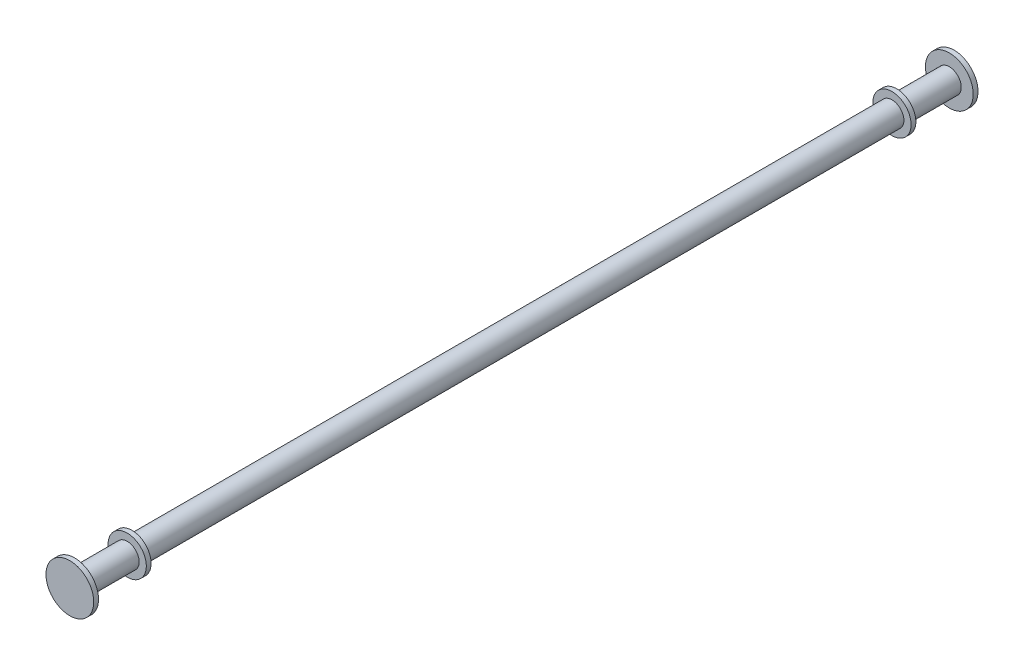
ISO-10303-21;
HEADER;
FILE_DESCRIPTION(('STEP AP214'),'2;1');
FILE_NAME('part.step','',(''),(''),'','','');
FILE_SCHEMA(('AUTOMOTIVE_DESIGN { 1 0 10303 214 1 1 1 1 }'));
ENDSEC;
DATA;
#1=APPLICATION_CONTEXT('core data for automotive mechanical design processes');
#2=APPLICATION_PROTOCOL_DEFINITION('international standard','automotive_design',2000,#1);
#3=PRODUCT_CONTEXT('',#1,'mechanical');
#4=PRODUCT('Part','Part','',(#3));
#5=PRODUCT_RELATED_PRODUCT_CATEGORY('part','',(#4));
#6=PRODUCT_DEFINITION_FORMATION('','',#4);
#7=PRODUCT_DEFINITION_CONTEXT('part definition',#1,'design');
#8=PRODUCT_DEFINITION('design','',#6,#7);
#9=PRODUCT_DEFINITION_SHAPE('','',#8);
#10=(LENGTH_UNIT() NAMED_UNIT(*) SI_UNIT(.MILLI.,.METRE.));
#11=(NAMED_UNIT(*) PLANE_ANGLE_UNIT() SI_UNIT($,.RADIAN.));
#12=(NAMED_UNIT(*) SI_UNIT($,.STERADIAN.) SOLID_ANGLE_UNIT());
#13=UNCERTAINTY_MEASURE_WITH_UNIT(LENGTH_MEASURE(1.E-05),#10,'distance_accuracy_value','');
#14=(GEOMETRIC_REPRESENTATION_CONTEXT(3) GLOBAL_UNCERTAINTY_ASSIGNED_CONTEXT((#13)) GLOBAL_UNIT_ASSIGNED_CONTEXT((#10,
#11,#12)) REPRESENTATION_CONTEXT('',''));
#15=CARTESIAN_POINT('',(0.,0.,0.));
#16=DIRECTION('',(0.,0.,1.));
#17=DIRECTION('',(1.,0.,0.));
#18=AXIS2_PLACEMENT_3D('',#15,#16,#17);
#19=CARTESIAN_POINT('',(0.,0.,185.));
#20=DIRECTION('',(0.,0.,-1.));
#21=DIRECTION('',(-1.,0.,0.));
#22=AXIS2_PLACEMENT_3D('',#19,#20,#21);
#23=CYLINDRICAL_SURFACE('',#22,2.5);
#24=CARTESIAN_POINT('',(0.,0.,12.));
#25=DIRECTION('',(0.,0.,-1.));
#26=DIRECTION('',(-1.,0.,0.));
#27=AXIS2_PLACEMENT_3D('',#24,#25,#26);
#28=CIRCLE('',#27,2.5);
#29=CARTESIAN_POINT('',(-2.5,0.,12.));
#30=VERTEX_POINT('',#29);
#31=EDGE_CURVE('E47',#30,#30,#28,.T.);
#32=ORIENTED_EDGE('',*,*,#31,.T.);
#33=EDGE_LOOP('',(#32));
#34=FACE_BOUND('',#33,.T.);
#35=CARTESIAN_POINT('',(0.,0.,1.));
#36=DIRECTION('',(0.,0.,-1.));
#37=DIRECTION('',(-1.,0.,0.));
#38=AXIS2_PLACEMENT_3D('',#35,#36,#37);
#39=CIRCLE('',#38,2.5);
#40=CARTESIAN_POINT('',(-2.5,0.,1.));
#41=VERTEX_POINT('',#40);
#42=EDGE_CURVE('E10',#41,#41,#39,.T.);
#43=ORIENTED_EDGE('',*,*,#42,.F.);
#44=EDGE_LOOP('',(#43));
#45=FACE_BOUND('',#44,.T.);
#46=ADVANCED_FACE('F29',(#34,#45),#23,.T.);
#47=CARTESIAN_POINT('',(0.,0.,173.));
#48=DIRECTION('',(0.,0.,1.));
#49=DIRECTION('',(1.,0.,0.));
#50=AXIS2_PLACEMENT_3D('',#47,#48,#49);
#51=CIRCLE('',#50,2.5);
#52=CARTESIAN_POINT('',(2.5,0.,173.));
#53=VERTEX_POINT('',#52);
#54=EDGE_CURVE('E52',#53,#53,#51,.T.);
#55=ORIENTED_EDGE('',*,*,#54,.T.);
#56=EDGE_LOOP('',(#55));
#57=FACE_BOUND('',#56,.T.);
#58=CARTESIAN_POINT('',(0.,0.,184.));
#59=DIRECTION('',(0.,0.,1.));
#60=DIRECTION('',(1.,0.,0.));
#61=AXIS2_PLACEMENT_3D('',#58,#59,#60);
#62=CIRCLE('',#61,2.5);
#63=CARTESIAN_POINT('',(2.5,0.,184.));
#64=VERTEX_POINT('',#63);
#65=EDGE_CURVE('E36',#64,#64,#62,.T.);
#66=ORIENTED_EDGE('',*,*,#65,.F.);
#67=EDGE_LOOP('',(#66));
#68=FACE_BOUND('',#67,.T.);
#69=ADVANCED_FACE('F31',(#57,#68),#23,.T.);
#70=CARTESIAN_POINT('',(0.,0.,172.));
#71=DIRECTION('',(0.,0.,1.));
#72=DIRECTION('',(1.,0.,0.));
#73=AXIS2_PLACEMENT_3D('',#70,#71,#72);
#74=CIRCLE('',#73,2.5);
#75=CARTESIAN_POINT('',(2.5,0.,172.));
#76=VERTEX_POINT('',#75);
#77=EDGE_CURVE('E44',#76,#76,#74,.T.);
#78=ORIENTED_EDGE('',*,*,#77,.F.);
#79=EDGE_LOOP('',(#78));
#80=FACE_BOUND('',#79,.T.);
#81=CARTESIAN_POINT('',(0.,0.,13.));
#82=DIRECTION('',(0.,0.,-1.));
#83=DIRECTION('',(-1.,0.,0.));
#84=AXIS2_PLACEMENT_3D('',#81,#82,#83);
#85=CIRCLE('',#84,2.5);
#86=CARTESIAN_POINT('',(-2.5,0.,13.));
#87=VERTEX_POINT('',#86);
#88=EDGE_CURVE('E40',#87,#87,#85,.T.);
#89=ORIENTED_EDGE('',*,*,#88,.F.);
#90=EDGE_LOOP('',(#89));
#91=FACE_BOUND('',#90,.T.);
#92=ADVANCED_FACE('F93',(#80,#91),#23,.T.);
#93=CARTESIAN_POINT('',(0.,0.,173.));
#94=DIRECTION('',(0.,0.,1.));
#95=DIRECTION('',(1.,0.,0.));
#96=AXIS2_PLACEMENT_3D('',#93,#94,#95);
#97=PLANE('',#96);
#98=CARTESIAN_POINT('',(0.,0.,173.));
#99=DIRECTION('',(0.,0.,1.));
#100=DIRECTION('',(1.,0.,0.));
#101=AXIS2_PLACEMENT_3D('',#98,#99,#100);
#102=CIRCLE('',#101,4.);
#103=CARTESIAN_POINT('',(4.,0.,173.));
#104=VERTEX_POINT('',#103);
#105=EDGE_CURVE('E55',#104,#104,#102,.T.);
#106=ORIENTED_EDGE('',*,*,#105,.T.);
#107=EDGE_LOOP('',(#106));
#108=FACE_BOUND('',#107,.T.);
#109=ORIENTED_EDGE('',*,*,#54,.F.);
#110=EDGE_LOOP('',(#109));
#111=FACE_BOUND('',#110,.T.);
#112=ADVANCED_FACE('F102',(#108,#111),#97,.T.);
#113=CARTESIAN_POINT('',(0.,0.,172.));
#114=DIRECTION('',(0.,0.,1.));
#115=DIRECTION('',(1.,0.,0.));
#116=AXIS2_PLACEMENT_3D('',#113,#114,#115);
#117=PLANE('',#116);
#118=CARTESIAN_POINT('',(0.,0.,172.));
#119=DIRECTION('',(0.,0.,1.));
#120=DIRECTION('',(1.,0.,0.));
#121=AXIS2_PLACEMENT_3D('',#118,#119,#120);
#122=CIRCLE('',#121,4.);
#123=CARTESIAN_POINT('',(4.,0.,172.));
#124=VERTEX_POINT('',#123);
#125=EDGE_CURVE('E49',#124,#124,#122,.T.);
#126=ORIENTED_EDGE('',*,*,#125,.F.);
#127=EDGE_LOOP('',(#126));
#128=FACE_BOUND('',#127,.T.);
#129=ORIENTED_EDGE('',*,*,#77,.T.);
#130=EDGE_LOOP('',(#129));
#131=FACE_BOUND('',#130,.T.);
#132=ADVANCED_FACE('F107',(#128,#131),#117,.F.);
#133=CARTESIAN_POINT('',(0.,0.,173.));
#134=DIRECTION('',(0.,0.,-1.));
#135=DIRECTION('',(-1.,0.,0.));
#136=AXIS2_PLACEMENT_3D('',#133,#134,#135);
#137=CYLINDRICAL_SURFACE('',#136,4.);
#138=ORIENTED_EDGE('',*,*,#105,.F.);
#139=EDGE_LOOP('',(#138));
#140=FACE_BOUND('',#139,.T.);
#141=ORIENTED_EDGE('',*,*,#125,.T.);
#142=EDGE_LOOP('',(#141));
#143=FACE_BOUND('',#142,.T.);
#144=ADVANCED_FACE('F127',(#140,#143),#137,.T.);
#145=CARTESIAN_POINT('',(0.,0.,12.));
#146=DIRECTION('',(0.,0.,-1.));
#147=DIRECTION('',(1.,0.,0.));
#148=AXIS2_PLACEMENT_3D('',#145,#146,#147);
#149=PLANE('',#148);
#150=CARTESIAN_POINT('',(0.,0.,12.));
#151=DIRECTION('',(0.,0.,1.));
#152=DIRECTION('',(1.,0.,0.));
#153=AXIS2_PLACEMENT_3D('',#150,#151,#152);
#154=CIRCLE('',#153,4.);
#155=CARTESIAN_POINT('',(4.,0.,12.));
#156=VERTEX_POINT('',#155);
#157=EDGE_CURVE('E50',#156,#156,#154,.T.);
#158=ORIENTED_EDGE('',*,*,#157,.F.);
#159=EDGE_LOOP('',(#158));
#160=FACE_BOUND('',#159,.T.);
#161=ORIENTED_EDGE('',*,*,#31,.F.);
#162=EDGE_LOOP('',(#161));
#163=FACE_BOUND('',#162,.T.);
#164=ADVANCED_FACE('F117',(#160,#163),#149,.T.);
#165=CARTESIAN_POINT('',(0.,0.,13.));
#166=DIRECTION('',(0.,0.,-1.));
#167=DIRECTION('',(1.,0.,0.));
#168=AXIS2_PLACEMENT_3D('',#165,#166,#167);
#169=PLANE('',#168);
#170=CARTESIAN_POINT('',(0.,0.,13.));
#171=DIRECTION('',(0.,0.,1.));
#172=DIRECTION('',(1.,0.,0.));
#173=AXIS2_PLACEMENT_3D('',#170,#171,#172);
#174=CIRCLE('',#173,4.);
#175=CARTESIAN_POINT('',(4.,0.,13.));
#176=VERTEX_POINT('',#175);
#177=EDGE_CURVE('E62',#176,#176,#174,.T.);
#178=ORIENTED_EDGE('',*,*,#177,.T.);
#179=EDGE_LOOP('',(#178));
#180=FACE_BOUND('',#179,.T.);
#181=ORIENTED_EDGE('',*,*,#88,.T.);
#182=EDGE_LOOP('',(#181));
#183=FACE_BOUND('',#182,.T.);
#184=ADVANCED_FACE('F114',(#180,#183),#169,.F.);
#185=CARTESIAN_POINT('',(0.,0.,12.));
#186=DIRECTION('',(0.,0.,1.));
#187=DIRECTION('',(1.,0.,0.));
#188=AXIS2_PLACEMENT_3D('',#185,#186,#187);
#189=CYLINDRICAL_SURFACE('',#188,4.);
#190=ORIENTED_EDGE('',*,*,#157,.T.);
#191=EDGE_LOOP('',(#190));
#192=FACE_BOUND('',#191,.T.);
#193=ORIENTED_EDGE('',*,*,#177,.F.);
#194=EDGE_LOOP('',(#193));
#195=FACE_BOUND('',#194,.T.);
#196=ADVANCED_FACE('F116',(#192,#195),#189,.T.);
#197=CARTESIAN_POINT('',(0.,0.,184.));
#198=DIRECTION('',(0.,0.,1.));
#199=DIRECTION('',(1.,0.,0.));
#200=AXIS2_PLACEMENT_3D('',#197,#198,#199);
#201=PLANE('',#200);
#202=CARTESIAN_POINT('',(0.,0.,184.));
#203=DIRECTION('',(0.,0.,1.));
#204=DIRECTION('',(1.,0.,0.));
#205=AXIS2_PLACEMENT_3D('',#202,#203,#204);
#206=CIRCLE('',#205,5.);
#207=CARTESIAN_POINT('',(5.,0.,184.));
#208=VERTEX_POINT('',#207);
#209=EDGE_CURVE('E68',#208,#208,#206,.T.);
#210=ORIENTED_EDGE('',*,*,#209,.F.);
#211=EDGE_LOOP('',(#210));
#212=FACE_BOUND('',#211,.T.);
#213=ORIENTED_EDGE('',*,*,#65,.T.);
#214=EDGE_LOOP('',(#213));
#215=FACE_BOUND('',#214,.T.);
#216=ADVANCED_FACE('F124',(#212,#215),#201,.F.);
#217=CARTESIAN_POINT('',(0.,0.,185.));
#218=DIRECTION('',(0.,0.,-1.));
#219=DIRECTION('',(-1.,0.,0.));
#220=AXIS2_PLACEMENT_3D('',#217,#218,#219);
#221=CYLINDRICAL_SURFACE('',#220,5.);
#222=CARTESIAN_POINT('',(0.,0.,185.));
#223=DIRECTION('',(0.,0.,1.));
#224=DIRECTION('',(1.,0.,0.));
#225=AXIS2_PLACEMENT_3D('',#222,#223,#224);
#226=CIRCLE('',#225,5.);
#227=CARTESIAN_POINT('',(5.,0.,185.));
#228=VERTEX_POINT('',#227);
#229=EDGE_CURVE('E65',#228,#228,#226,.T.);
#230=ORIENTED_EDGE('',*,*,#229,.F.);
#231=EDGE_LOOP('',(#230));
#232=FACE_BOUND('',#231,.T.);
#233=ORIENTED_EDGE('',*,*,#209,.T.);
#234=EDGE_LOOP('',(#233));
#235=FACE_BOUND('',#234,.T.);
#236=ADVANCED_FACE('F139',(#232,#235),#221,.T.);
#237=CARTESIAN_POINT('',(0.,0.,185.));
#238=DIRECTION('',(0.,0.,1.));
#239=DIRECTION('',(1.,0.,0.));
#240=AXIS2_PLACEMENT_3D('',#237,#238,#239);
#241=PLANE('',#240);
#242=ORIENTED_EDGE('',*,*,#229,.T.);
#243=EDGE_LOOP('',(#242));
#244=FACE_BOUND('',#243,.T.);
#245=ADVANCED_FACE('F137',(#244),#241,.T.);
#246=CARTESIAN_POINT('',(0.,0.,1.));
#247=DIRECTION('',(0.,0.,-1.));
#248=DIRECTION('',(1.,0.,0.));
#249=AXIS2_PLACEMENT_3D('',#246,#247,#248);
#250=PLANE('',#249);
#251=CARTESIAN_POINT('',(0.,0.,1.));
#252=DIRECTION('',(0.,0.,1.));
#253=DIRECTION('',(1.,0.,0.));
#254=AXIS2_PLACEMENT_3D('',#251,#252,#253);
#255=CIRCLE('',#254,5.);
#256=CARTESIAN_POINT('',(5.,0.,1.));
#257=VERTEX_POINT('',#256);
#258=EDGE_CURVE('E74',#257,#257,#255,.T.);
#259=ORIENTED_EDGE('',*,*,#258,.T.);
#260=EDGE_LOOP('',(#259));
#261=FACE_BOUND('',#260,.T.);
#262=ORIENTED_EDGE('',*,*,#42,.T.);
#263=EDGE_LOOP('',(#262));
#264=FACE_BOUND('',#263,.T.);
#265=ADVANCED_FACE('F88',(#261,#264),#250,.F.);
#266=CARTESIAN_POINT('',(0.,0.,0.));
#267=DIRECTION('',(0.,0.,1.));
#268=DIRECTION('',(1.,0.,0.));
#269=AXIS2_PLACEMENT_3D('',#266,#267,#268);
#270=CYLINDRICAL_SURFACE('',#269,5.);
#271=CARTESIAN_POINT('',(0.,0.,0.));
#272=DIRECTION('',(0.,0.,1.));
#273=DIRECTION('',(1.,0.,0.));
#274=AXIS2_PLACEMENT_3D('',#271,#272,#273);
#275=CIRCLE('',#274,5.);
#276=CARTESIAN_POINT('',(5.,0.,0.));
#277=VERTEX_POINT('',#276);
#278=EDGE_CURVE('E71',#277,#277,#275,.T.);
#279=ORIENTED_EDGE('',*,*,#278,.T.);
#280=EDGE_LOOP('',(#279));
#281=FACE_BOUND('',#280,.T.);
#282=ORIENTED_EDGE('',*,*,#258,.F.);
#283=EDGE_LOOP('',(#282));
#284=FACE_BOUND('',#283,.T.);
#285=ADVANCED_FACE('F80',(#281,#284),#270,.T.);
#286=CARTESIAN_POINT('',(0.,0.,0.));
#287=DIRECTION('',(0.,0.,1.));
#288=DIRECTION('',(1.,0.,0.));
#289=AXIS2_PLACEMENT_3D('',#286,#287,#288);
#290=PLANE('',#289);
#291=ORIENTED_EDGE('',*,*,#278,.F.);
#292=EDGE_LOOP('',(#291));
#293=FACE_BOUND('',#292,.T.);
#294=ADVANCED_FACE('F83',(#293),#290,.F.);
#295=CLOSED_SHELL('',(#46,#69,#92,#112,#132,#144,#164,#184,#196,#216,#236,#245,#265,#285,#294));
#296=MANIFOLD_SOLID_BREP('B2',#295);
#297=ADVANCED_BREP_SHAPE_REPRESENTATION('',(#18,#296),#14);
#298=SHAPE_DEFINITION_REPRESENTATION(#9,#297);
ENDSEC;
END-ISO-10303-21;
